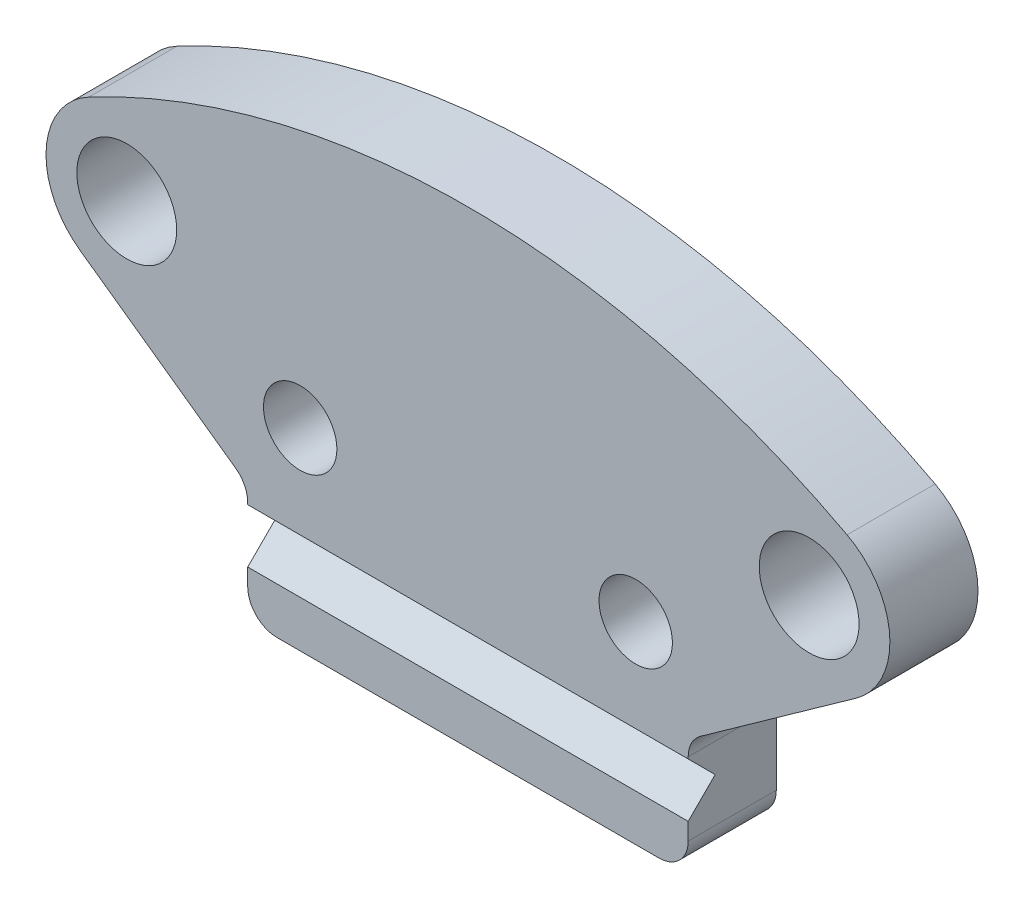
ISO-10303-21;
HEADER;
FILE_DESCRIPTION(('STEP AP214'),'2;1');
FILE_NAME('part.step','',(''),(''),'','','');
FILE_SCHEMA(('AUTOMOTIVE_DESIGN { 1 0 10303 214 1 1 1 1 }'));
ENDSEC;
DATA;
#1=APPLICATION_CONTEXT('core data for automotive mechanical design processes');
#2=APPLICATION_PROTOCOL_DEFINITION('international standard','automotive_design',2000,#1);
#3=PRODUCT_CONTEXT('',#1,'mechanical');
#4=PRODUCT('Part','Part','',(#3));
#5=PRODUCT_RELATED_PRODUCT_CATEGORY('part','',(#4));
#6=PRODUCT_DEFINITION_FORMATION('','',#4);
#7=PRODUCT_DEFINITION_CONTEXT('part definition',#1,'design');
#8=PRODUCT_DEFINITION('design','',#6,#7);
#9=PRODUCT_DEFINITION_SHAPE('','',#8);
#10=(LENGTH_UNIT() NAMED_UNIT(*) SI_UNIT(.MILLI.,.METRE.));
#11=(NAMED_UNIT(*) PLANE_ANGLE_UNIT() SI_UNIT($,.RADIAN.));
#12=(NAMED_UNIT(*) SI_UNIT($,.STERADIAN.) SOLID_ANGLE_UNIT());
#13=UNCERTAINTY_MEASURE_WITH_UNIT(LENGTH_MEASURE(1.E-05),#10,'distance_accuracy_value','');
#14=(GEOMETRIC_REPRESENTATION_CONTEXT(3) GLOBAL_UNCERTAINTY_ASSIGNED_CONTEXT((#13)) GLOBAL_UNIT_ASSIGNED_CONTEXT((#10,
#11,#12)) REPRESENTATION_CONTEXT('',''));
#15=CARTESIAN_POINT('',(0.,0.,0.));
#16=DIRECTION('',(0.,0.,1.));
#17=DIRECTION('',(1.,0.,0.));
#18=AXIS2_PLACEMENT_3D('',#15,#16,#17);
#19=CARTESIAN_POINT('',(-4.99384821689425E-13,8.45677694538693E-13,3.));
#20=DIRECTION('',(0.,0.,1.));
#21=DIRECTION('',(1.,0.,0.));
#22=AXIS2_PLACEMENT_3D('',#19,#20,#21);
#23=PLANE('',#22);
#24=DIRECTION('',(1.,0.,0.));
#25=VECTOR('',#24,1.);
#26=CARTESIAN_POINT('',(-9.59025579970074,11.544994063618,3.));
#27=LINE('',#26,#25);
#28=CARTESIAN_POINT('',(-6.5,11.544994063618,3.));
#29=VERTEX_POINT('',#28);
#30=CARTESIAN_POINT('',(6.5,11.544994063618,3.));
#31=VERTEX_POINT('',#30);
#32=EDGE_CURVE('E206',#29,#31,#27,.T.);
#33=ORIENTED_EDGE('',*,*,#32,.T.);
#34=CARTESIAN_POINT('',(6.5,12.544994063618,3.));
#35=DIRECTION('',(0.,0.,1.));
#36=DIRECTION('',(1.,0.,0.));
#37=AXIS2_PLACEMENT_3D('',#34,#35,#36);
#38=CIRCLE('',#37,1.);
#39=CARTESIAN_POINT('',(7.5,12.544994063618,3.));
#40=VERTEX_POINT('',#39);
#41=EDGE_CURVE('E231',#31,#40,#38,.T.);
#42=ORIENTED_EDGE('',*,*,#41,.T.);
#43=DIRECTION('',(0.,-1.,0.));
#44=VECTOR('',#43,1.);
#45=CARTESIAN_POINT('',(7.5,8.45677694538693E-13,3.));
#46=LINE('',#45,#44);
#47=CARTESIAN_POINT('',(7.5,13.1257552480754,3.));
#48=VERTEX_POINT('',#47);
#49=EDGE_CURVE('E286',#48,#40,#46,.T.);
#50=ORIENTED_EDGE('',*,*,#49,.F.);
#51=DIRECTION('',(-1.,0.,0.));
#52=VECTOR('',#51,1.);
#53=CARTESIAN_POINT('',(15.6377840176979,13.1257552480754,3.));
#54=LINE('',#53,#52);
#55=CARTESIAN_POINT('',(-7.5,13.1257552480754,3.));
#56=VERTEX_POINT('',#55);
#57=EDGE_CURVE('E176',#48,#56,#54,.T.);
#58=ORIENTED_EDGE('',*,*,#57,.T.);
#59=DIRECTION('',(0.,1.,0.));
#60=VECTOR('',#59,1.);
#61=CARTESIAN_POINT('',(-7.5,8.45677694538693E-13,3.));
#62=LINE('',#61,#60);
#63=CARTESIAN_POINT('',(-7.5,12.544994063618,3.));
#64=VERTEX_POINT('',#63);
#65=EDGE_CURVE('E247',#64,#56,#62,.T.);
#66=ORIENTED_EDGE('',*,*,#65,.F.);
#67=CARTESIAN_POINT('',(-6.5,12.544994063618,3.));
#68=DIRECTION('',(0.,0.,1.));
#69=DIRECTION('',(1.,0.,0.));
#70=AXIS2_PLACEMENT_3D('',#67,#68,#69);
#71=CIRCLE('',#70,1.);
#72=EDGE_CURVE('E229',#64,#29,#71,.T.);
#73=ORIENTED_EDGE('',*,*,#72,.T.);
#74=EDGE_LOOP('',(#33,#42,#50,#58,#66,#73));
#75=FACE_BOUND('',#74,.T.);
#76=ADVANCED_FACE('F35',(#75),#23,.T.);
#77=DIRECTION('',(0.,1.,0.));
#78=VECTOR('',#77,1.);
#79=CARTESIAN_POINT('',(-7.5,8.45677694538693E-13,3.));
#80=LINE('',#79,#78);
#81=CARTESIAN_POINT('',(-7.5,14.9642328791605,3.));
#82=VERTEX_POINT('',#81);
#83=CARTESIAN_POINT('',(-7.5,15.0293511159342,3.));
#84=VERTEX_POINT('',#83);
#85=EDGE_CURVE('E291',#82,#84,#80,.T.);
#86=ORIENTED_EDGE('',*,*,#85,.F.);
#87=DIRECTION('',(-1.,0.,0.));
#88=VECTOR('',#87,1.);
#89=CARTESIAN_POINT('',(15.6377840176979,14.9642328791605,3.));
#90=LINE('',#89,#88);
#91=CARTESIAN_POINT('',(7.5,14.9642328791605,3.));
#92=VERTEX_POINT('',#91);
#93=EDGE_CURVE('E166',#92,#82,#90,.T.);
#94=ORIENTED_EDGE('',*,*,#93,.F.);
#95=DIRECTION('',(0.,-1.,0.));
#96=VECTOR('',#95,1.);
#97=CARTESIAN_POINT('',(7.5,8.45677694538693E-13,3.));
#98=LINE('',#97,#96);
#99=CARTESIAN_POINT('',(7.5,15.0293511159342,3.));
#100=VERTEX_POINT('',#99);
#101=EDGE_CURVE('E284',#100,#92,#98,.T.);
#102=ORIENTED_EDGE('',*,*,#101,.F.);
#103=CARTESIAN_POINT('',(8.5,15.0293511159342,3.));
#104=DIRECTION('',(0.,0.,1.));
#105=DIRECTION('',(1.,0.,0.));
#106=AXIS2_PLACEMENT_3D('',#103,#104,#105);
#107=CIRCLE('',#106,1.);
#108=CARTESIAN_POINT('',(7.92008095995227,15.8440252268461,3.));
#109=VERTEX_POINT('',#108);
#110=EDGE_CURVE('E165',#100,#109,#107,.F.);
#111=ORIENTED_EDGE('',*,*,#110,.T.);
#112=DIRECTION('',(-0.81467411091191,-0.579919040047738,0.));
#113=VECTOR('',#112,1.);
#114=CARTESIAN_POINT('',(-4.82185946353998,6.77378013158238,3.));
#115=LINE('',#114,#113);
#116=CARTESIAN_POINT('',(13.2141985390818,19.612599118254,3.000006));
#117=VERTEX_POINT('',#116);
#118=EDGE_CURVE('E150',#117,#109,#115,.T.);
#119=ORIENTED_EDGE('',*,*,#118,.F.);
#120=CARTESIAN_POINT('',(11.6194211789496,21.8529529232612,3.));
#121=DIRECTION('',(0.,0.,1.));
#122=DIRECTION('',(1.,0.,0.));
#123=AXIS2_PLACEMENT_3D('',#120,#121,#122);
#124=CIRCLE('',#123,2.75000000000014);
#125=CARTESIAN_POINT('',(12.9104679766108,24.2810588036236,3.));
#126=VERTEX_POINT('',#125);
#127=EDGE_CURVE('E141',#126,#117,#124,.F.);
#128=ORIENTED_EDGE('',*,*,#127,.F.);
#129=CARTESIAN_POINT('',(-4.99384821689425E-13,8.45677694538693E-13,3.));
#130=DIRECTION('',(0.,0.,1.));
#131=DIRECTION('',(1.,0.,0.));
#132=AXIS2_PLACEMENT_3D('',#129,#130,#131);
#133=CIRCLE('',#132,27.5000000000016);
#134=CARTESIAN_POINT('',(-12.9104679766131,24.2810588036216,3.));
#135=VERTEX_POINT('',#134);
#136=EDGE_CURVE('E151',#135,#126,#133,.F.);
#137=ORIENTED_EDGE('',*,*,#136,.F.);
#138=CARTESIAN_POINT('',(-11.6194211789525,21.8529529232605,3.));
#139=DIRECTION('',(0.,0.,1.));
#140=DIRECTION('',(1.,0.,0.));
#141=AXIS2_PLACEMENT_3D('',#138,#139,#140);
#142=CIRCLE('',#141,2.74999999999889);
#143=CARTESIAN_POINT('',(-13.2141985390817,19.6125991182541,3.));
#144=VERTEX_POINT('',#143);
#145=EDGE_CURVE('E246',#144,#135,#142,.F.);
#146=ORIENTED_EDGE('',*,*,#145,.F.);
#147=DIRECTION('',(-0.81467411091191,0.579919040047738,0.));
#148=VECTOR('',#147,1.);
#149=CARTESIAN_POINT('',(4.82185946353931,6.77378013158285,3.));
#150=LINE('',#149,#148);
#151=CARTESIAN_POINT('',(-7.92008095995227,15.8440252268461,3.));
#152=VERTEX_POINT('',#151);
#153=EDGE_CURVE('E243',#152,#144,#150,.T.);
#154=ORIENTED_EDGE('',*,*,#153,.F.);
#155=CARTESIAN_POINT('',(-8.5,15.0293511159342,3.));
#156=DIRECTION('',(0.,0.,1.));
#157=DIRECTION('',(1.,0.,0.));
#158=AXIS2_PLACEMENT_3D('',#155,#156,#157);
#159=CIRCLE('',#158,1.);
#160=EDGE_CURVE('E43',#152,#84,#159,.F.);
#161=ORIENTED_EDGE('',*,*,#160,.T.);
#162=EDGE_LOOP('',(#86,#94,#102,#111,#119,#128,#137,#146,#154,#161));
#163=FACE_BOUND('',#162,.T.);
#164=CARTESIAN_POINT('',(5.7134101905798,18.1206220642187,3.));
#165=DIRECTION('',(0.,0.,1.));
#166=DIRECTION('',(1.,0.,0.));
#167=AXIS2_PLACEMENT_3D('',#164,#165,#166);
#168=CIRCLE('',#167,1.25);
#169=CARTESIAN_POINT('',(6.9634101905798,18.1206220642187,3.));
#170=VERTEX_POINT('',#169);
#171=EDGE_CURVE('E179',#170,#170,#168,.T.);
#172=ORIENTED_EDGE('',*,*,#171,.F.);
#173=EDGE_LOOP('',(#172));
#174=FACE_BOUND('',#173,.T.);
#175=CARTESIAN_POINT('',(-5.71341019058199,18.1206220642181,3.));
#176=DIRECTION('',(0.,0.,1.));
#177=DIRECTION('',(1.,0.,0.));
#178=AXIS2_PLACEMENT_3D('',#175,#176,#177);
#179=CIRCLE('',#178,1.25);
#180=CARTESIAN_POINT('',(-4.46341019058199,18.1206220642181,3.));
#181=VERTEX_POINT('',#180);
#182=EDGE_CURVE('E187',#181,#181,#179,.T.);
#183=ORIENTED_EDGE('',*,*,#182,.F.);
#184=EDGE_LOOP('',(#183));
#185=FACE_BOUND('',#184,.T.);
#186=CARTESIAN_POINT('',(11.6194211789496,21.8529529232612,3.));
#187=DIRECTION('',(0.,0.,1.));
#188=DIRECTION('',(1.,0.,0.));
#189=AXIS2_PLACEMENT_3D('',#186,#187,#188);
#190=CIRCLE('',#189,1.7);
#191=CARTESIAN_POINT('',(13.3194211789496,21.8529529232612,3.));
#192=VERTEX_POINT('',#191);
#193=EDGE_CURVE('E200',#192,#192,#190,.T.);
#194=ORIENTED_EDGE('',*,*,#193,.F.);
#195=EDGE_LOOP('',(#194));
#196=FACE_BOUND('',#195,.T.);
#197=CARTESIAN_POINT('',(-11.6194211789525,21.8529529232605,3.));
#198=DIRECTION('',(0.,0.,1.));
#199=DIRECTION('',(1.,0.,0.));
#200=AXIS2_PLACEMENT_3D('',#197,#198,#199);
#201=CIRCLE('',#200,1.7);
#202=CARTESIAN_POINT('',(-9.91942117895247,21.8529529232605,3.));
#203=VERTEX_POINT('',#202);
#204=EDGE_CURVE('E194',#203,#203,#201,.T.);
#205=ORIENTED_EDGE('',*,*,#204,.F.);
#206=EDGE_LOOP('',(#205));
#207=FACE_BOUND('',#206,.T.);
#208=ADVANCED_FACE('F162',(#163,#174,#185,#196,#207),#23,.T.);
#209=CARTESIAN_POINT('',(-4.99384821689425E-13,8.45677694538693E-13,0.));
#210=DIRECTION('',(0.,0.,1.));
#211=DIRECTION('',(1.,0.,0.));
#212=AXIS2_PLACEMENT_3D('',#209,#210,#211);
#213=PLANE('',#212);
#214=CARTESIAN_POINT('',(5.7134101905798,18.1206220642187,0.));
#215=DIRECTION('',(0.,0.,1.));
#216=DIRECTION('',(1.,0.,0.));
#217=AXIS2_PLACEMENT_3D('',#214,#215,#216);
#218=CIRCLE('',#217,1.25);
#219=CARTESIAN_POINT('',(6.9634101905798,18.1206220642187,0.));
#220=VERTEX_POINT('',#219);
#221=EDGE_CURVE('E184',#220,#220,#218,.T.);
#222=ORIENTED_EDGE('',*,*,#221,.T.);
#223=EDGE_LOOP('',(#222));
#224=FACE_BOUND('',#223,.T.);
#225=CARTESIAN_POINT('',(-5.71341019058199,18.1206220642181,0.));
#226=DIRECTION('',(0.,0.,1.));
#227=DIRECTION('',(1.,0.,0.));
#228=AXIS2_PLACEMENT_3D('',#225,#226,#227);
#229=CIRCLE('',#228,1.25);
#230=CARTESIAN_POINT('',(-4.46341019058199,18.1206220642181,0.));
#231=VERTEX_POINT('',#230);
#232=EDGE_CURVE('E190',#231,#231,#229,.T.);
#233=ORIENTED_EDGE('',*,*,#232,.T.);
#234=EDGE_LOOP('',(#233));
#235=FACE_BOUND('',#234,.T.);
#236=DIRECTION('',(0.,-1.,0.));
#237=VECTOR('',#236,1.);
#238=CARTESIAN_POINT('',(7.5,15.544994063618,0.));
#239=LINE('',#238,#237);
#240=CARTESIAN_POINT('',(7.5,15.0293511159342,0.));
#241=VERTEX_POINT('',#240);
#242=CARTESIAN_POINT('',(7.5,12.544994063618,0.));
#243=VERTEX_POINT('',#242);
#244=EDGE_CURVE('E317',#241,#243,#239,.T.);
#245=ORIENTED_EDGE('',*,*,#244,.T.);
#246=CARTESIAN_POINT('',(6.5,12.544994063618,0.));
#247=DIRECTION('',(0.,0.,1.));
#248=DIRECTION('',(1.,0.,0.));
#249=AXIS2_PLACEMENT_3D('',#246,#247,#248);
#250=CIRCLE('',#249,1.);
#251=CARTESIAN_POINT('',(6.5,11.544994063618,0.));
#252=VERTEX_POINT('',#251);
#253=EDGE_CURVE('E235',#243,#252,#250,.F.);
#254=ORIENTED_EDGE('',*,*,#253,.T.);
#255=DIRECTION('',(1.,0.,0.));
#256=VECTOR('',#255,1.);
#257=CARTESIAN_POINT('',(-9.59025579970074,11.544994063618,0.));
#258=LINE('',#257,#256);
#259=CARTESIAN_POINT('',(-6.5,11.544994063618,0.));
#260=VERTEX_POINT('',#259);
#261=EDGE_CURVE('E203',#260,#252,#258,.T.);
#262=ORIENTED_EDGE('',*,*,#261,.F.);
#263=CARTESIAN_POINT('',(-6.5,12.544994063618,0.));
#264=DIRECTION('',(0.,0.,1.));
#265=DIRECTION('',(1.,0.,0.));
#266=AXIS2_PLACEMENT_3D('',#263,#264,#265);
#267=CIRCLE('',#266,1.);
#268=CARTESIAN_POINT('',(-7.5,12.544994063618,0.));
#269=VERTEX_POINT('',#268);
#270=EDGE_CURVE('E233',#260,#269,#267,.F.);
#271=ORIENTED_EDGE('',*,*,#270,.T.);
#272=DIRECTION('',(0.,1.,0.));
#273=VECTOR('',#272,1.);
#274=CARTESIAN_POINT('',(-7.5,15.544994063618,0.));
#275=LINE('',#274,#273);
#276=CARTESIAN_POINT('',(-7.5,15.0293511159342,0.));
#277=VERTEX_POINT('',#276);
#278=EDGE_CURVE('E325',#269,#277,#275,.T.);
#279=ORIENTED_EDGE('',*,*,#278,.T.);
#280=CARTESIAN_POINT('',(-8.5,15.0293511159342,0.));
#281=DIRECTION('',(0.,0.,1.));
#282=DIRECTION('',(1.,0.,0.));
#283=AXIS2_PLACEMENT_3D('',#280,#281,#282);
#284=CIRCLE('',#283,1.);
#285=CARTESIAN_POINT('',(-7.92008095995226,15.8440252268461,0.));
#286=VERTEX_POINT('',#285);
#287=EDGE_CURVE('E11',#277,#286,#284,.T.);
#288=ORIENTED_EDGE('',*,*,#287,.T.);
#289=DIRECTION('',(-0.81467411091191,0.579919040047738,0.));
#290=VECTOR('',#289,1.);
#291=CARTESIAN_POINT('',(-13.2141985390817,19.6125991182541,0.));
#292=LINE('',#291,#290);
#293=CARTESIAN_POINT('',(-13.2141985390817,19.6125991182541,0.));
#294=VERTEX_POINT('',#293);
#295=EDGE_CURVE('E327',#286,#294,#292,.T.);
#296=ORIENTED_EDGE('',*,*,#295,.T.);
#297=CARTESIAN_POINT('',(-11.6194211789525,21.8529529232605,0.));
#298=DIRECTION('',(0.,0.,-1.));
#299=DIRECTION('',(1.,0.,0.));
#300=AXIS2_PLACEMENT_3D('',#297,#298,#299);
#301=CIRCLE('',#300,2.74999999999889);
#302=CARTESIAN_POINT('',(-12.9104679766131,24.2810588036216,0.));
#303=VERTEX_POINT('',#302);
#304=EDGE_CURVE('E269',#294,#303,#301,.T.);
#305=ORIENTED_EDGE('',*,*,#304,.T.);
#306=CARTESIAN_POINT('',(-4.99384821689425E-13,8.45677694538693E-13,0.));
#307=DIRECTION('',(0.,0.,-1.));
#308=DIRECTION('',(1.,0.,0.));
#309=AXIS2_PLACEMENT_3D('',#306,#307,#308);
#310=CIRCLE('',#309,27.5000000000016);
#311=CARTESIAN_POINT('',(12.9104679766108,24.2810588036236,0.));
#312=VERTEX_POINT('',#311);
#313=EDGE_CURVE('E275',#303,#312,#310,.T.);
#314=ORIENTED_EDGE('',*,*,#313,.T.);
#315=CARTESIAN_POINT('',(11.6194211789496,21.8529529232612,0.));
#316=DIRECTION('',(0.,0.,-1.));
#317=DIRECTION('',(1.,0.,0.));
#318=AXIS2_PLACEMENT_3D('',#315,#316,#317);
#319=CIRCLE('',#318,2.75000000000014);
#320=CARTESIAN_POINT('',(13.2141985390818,19.612599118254,0.));
#321=VERTEX_POINT('',#320);
#322=EDGE_CURVE('E272',#312,#321,#319,.T.);
#323=ORIENTED_EDGE('',*,*,#322,.T.);
#324=DIRECTION('',(-0.81467411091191,-0.579919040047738,0.));
#325=VECTOR('',#324,1.);
#326=CARTESIAN_POINT('',(13.2141985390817,19.6125991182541,0.));
#327=LINE('',#326,#325);
#328=CARTESIAN_POINT('',(7.92008095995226,15.8440252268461,0.));
#329=VERTEX_POINT('',#328);
#330=EDGE_CURVE('E158',#321,#329,#327,.T.);
#331=ORIENTED_EDGE('',*,*,#330,.T.);
#332=CARTESIAN_POINT('',(8.5,15.0293511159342,0.));
#333=DIRECTION('',(0.,0.,1.));
#334=DIRECTION('',(1.,0.,0.));
#335=AXIS2_PLACEMENT_3D('',#332,#333,#334);
#336=CIRCLE('',#335,1.);
#337=EDGE_CURVE('E337',#329,#241,#336,.T.);
#338=ORIENTED_EDGE('',*,*,#337,.T.);
#339=EDGE_LOOP('',(#245,#254,#262,#271,#279,#288,#296,#305,#314,#323,#331,#338));
#340=FACE_BOUND('',#339,.T.);
#341=CARTESIAN_POINT('',(11.6194211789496,21.8529529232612,0.));
#342=DIRECTION('',(0.,0.,1.));
#343=DIRECTION('',(1.,0.,0.));
#344=AXIS2_PLACEMENT_3D('',#341,#342,#343);
#345=CIRCLE('',#344,1.7);
#346=CARTESIAN_POINT('',(13.3194211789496,21.8529529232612,0.));
#347=VERTEX_POINT('',#346);
#348=EDGE_CURVE('E197',#347,#347,#345,.T.);
#349=ORIENTED_EDGE('',*,*,#348,.T.);
#350=EDGE_LOOP('',(#349));
#351=FACE_BOUND('',#350,.T.);
#352=CARTESIAN_POINT('',(-11.6194211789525,21.8529529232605,0.));
#353=DIRECTION('',(0.,0.,1.));
#354=DIRECTION('',(1.,0.,0.));
#355=AXIS2_PLACEMENT_3D('',#352,#353,#354);
#356=CIRCLE('',#355,1.7);
#357=CARTESIAN_POINT('',(-9.91942117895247,21.8529529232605,0.));
#358=VERTEX_POINT('',#357);
#359=EDGE_CURVE('E193',#358,#358,#356,.T.);
#360=ORIENTED_EDGE('',*,*,#359,.T.);
#361=EDGE_LOOP('',(#360));
#362=FACE_BOUND('',#361,.T.);
#363=ADVANCED_FACE('F314',(#224,#235,#340,#351,#362),#213,.F.);
#364=CARTESIAN_POINT('',(-9.59025579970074,11.544994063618,3.));
#365=DIRECTION('',(0.,1.,0.));
#366=DIRECTION('',(-1.,0.,0.));
#367=AXIS2_PLACEMENT_3D('',#364,#365,#366);
#368=PLANE('',#367);
#369=ORIENTED_EDGE('',*,*,#261,.T.);
#370=DIRECTION('',(0.,0.,1.));
#371=VECTOR('',#370,1.);
#372=CARTESIAN_POINT('',(6.5,11.544994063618,3.));
#373=LINE('',#372,#371);
#374=EDGE_CURVE('E226',#252,#31,#373,.T.);
#375=ORIENTED_EDGE('',*,*,#374,.T.);
#376=ORIENTED_EDGE('',*,*,#32,.F.);
#377=DIRECTION('',(0.,0.,1.));
#378=VECTOR('',#377,1.);
#379=CARTESIAN_POINT('',(-6.5,11.544994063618,3.));
#380=LINE('',#379,#378);
#381=EDGE_CURVE('E224',#29,#260,#380,.F.);
#382=ORIENTED_EDGE('',*,*,#381,.T.);
#383=EDGE_LOOP('',(#369,#375,#376,#382));
#384=FACE_BOUND('',#383,.T.);
#385=ADVANCED_FACE('F319',(#384),#368,.F.);
#386=CARTESIAN_POINT('',(11.6194211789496,21.8529529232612,3.));
#387=DIRECTION('',(0.,0.,-1.));
#388=DIRECTION('',(-1.,0.,0.));
#389=AXIS2_PLACEMENT_3D('',#386,#387,#388);
#390=CYLINDRICAL_SURFACE('',#389,1.7);
#391=ORIENTED_EDGE('',*,*,#193,.T.);
#392=EDGE_LOOP('',(#391));
#393=FACE_BOUND('',#392,.T.);
#394=ORIENTED_EDGE('',*,*,#348,.F.);
#395=EDGE_LOOP('',(#394));
#396=FACE_BOUND('',#395,.T.);
#397=ADVANCED_FACE('F360',(#393,#396),#390,.F.);
#398=CARTESIAN_POINT('',(-11.6194211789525,21.8529529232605,3.));
#399=DIRECTION('',(0.,0.,-1.));
#400=DIRECTION('',(-1.,0.,0.));
#401=AXIS2_PLACEMENT_3D('',#398,#399,#400);
#402=CYLINDRICAL_SURFACE('',#401,1.7);
#403=ORIENTED_EDGE('',*,*,#204,.T.);
#404=EDGE_LOOP('',(#403));
#405=FACE_BOUND('',#404,.T.);
#406=ORIENTED_EDGE('',*,*,#359,.F.);
#407=EDGE_LOOP('',(#406));
#408=FACE_BOUND('',#407,.T.);
#409=ADVANCED_FACE('F369',(#405,#408),#402,.F.);
#410=CARTESIAN_POINT('',(-5.71341019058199,18.1206220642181,3.));
#411=DIRECTION('',(0.,0.,1.));
#412=DIRECTION('',(1.,0.,0.));
#413=AXIS2_PLACEMENT_3D('',#410,#411,#412);
#414=CYLINDRICAL_SURFACE('',#413,1.25);
#415=ORIENTED_EDGE('',*,*,#232,.F.);
#416=EDGE_LOOP('',(#415));
#417=FACE_BOUND('',#416,.T.);
#418=ORIENTED_EDGE('',*,*,#182,.T.);
#419=EDGE_LOOP('',(#418));
#420=FACE_BOUND('',#419,.T.);
#421=ADVANCED_FACE('F374',(#417,#420),#414,.F.);
#422=CARTESIAN_POINT('',(5.7134101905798,18.1206220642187,3.));
#423=DIRECTION('',(0.,0.,1.));
#424=DIRECTION('',(1.,0.,0.));
#425=AXIS2_PLACEMENT_3D('',#422,#423,#424);
#426=CYLINDRICAL_SURFACE('',#425,1.25);
#427=ORIENTED_EDGE('',*,*,#221,.F.);
#428=EDGE_LOOP('',(#427));
#429=FACE_BOUND('',#428,.T.);
#430=ORIENTED_EDGE('',*,*,#171,.T.);
#431=EDGE_LOOP('',(#430));
#432=FACE_BOUND('',#431,.T.);
#433=ADVANCED_FACE('F388',(#429,#432),#426,.F.);
#434=CARTESIAN_POINT('',(15.6377840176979,14.0449940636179,2.08076118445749));
#435=DIRECTION('',(0.,-0.707106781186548,-0.707106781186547));
#436=DIRECTION('',(0.,0.707106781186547,-0.707106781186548));
#437=AXIS2_PLACEMENT_3D('',#434,#435,#436);
#438=PLANE('',#437);
#439=DIRECTION('',(-1.,0.,0.));
#440=VECTOR('',#439,1.);
#441=CARTESIAN_POINT('',(15.6377840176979,14.0449940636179,2.08076118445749));
#442=LINE('',#441,#440);
#443=CARTESIAN_POINT('',(7.5,14.0449940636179,2.08076118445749));
#444=VERTEX_POINT('',#443);
#445=CARTESIAN_POINT('',(-7.5,14.0449940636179,2.08076118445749));
#446=VERTEX_POINT('',#445);
#447=EDGE_CURVE('E169',#444,#446,#442,.T.);
#448=ORIENTED_EDGE('',*,*,#447,.T.);
#449=DIRECTION('',(0.,-0.707106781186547,0.707106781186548));
#450=VECTOR('',#449,1.);
#451=CARTESIAN_POINT('',(-7.5,14.0449940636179,2.08076118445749));
#452=LINE('',#451,#450);
#453=EDGE_CURVE('E289',#446,#56,#452,.T.);
#454=ORIENTED_EDGE('',*,*,#453,.T.);
#455=ORIENTED_EDGE('',*,*,#57,.F.);
#456=DIRECTION('',(0.,0.707106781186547,-0.707106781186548));
#457=VECTOR('',#456,1.);
#458=CARTESIAN_POINT('',(7.5,14.0449940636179,2.08076118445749));
#459=LINE('',#458,#457);
#460=EDGE_CURVE('E160',#48,#444,#459,.T.);
#461=ORIENTED_EDGE('',*,*,#460,.T.);
#462=EDGE_LOOP('',(#448,#454,#455,#461));
#463=FACE_BOUND('',#462,.T.);
#464=ADVANCED_FACE('F300',(#463),#438,.F.);
#465=CARTESIAN_POINT('',(15.6377840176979,14.9642328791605,3.));
#466=DIRECTION('',(0.,0.707106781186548,-0.707106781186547));
#467=DIRECTION('',(0.,0.707106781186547,0.707106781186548));
#468=AXIS2_PLACEMENT_3D('',#465,#466,#467);
#469=PLANE('',#468);
#470=ORIENTED_EDGE('',*,*,#93,.T.);
#471=DIRECTION('',(0.,-0.707106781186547,-0.707106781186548));
#472=VECTOR('',#471,1.);
#473=CARTESIAN_POINT('',(-7.5,14.9642328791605,3.));
#474=LINE('',#473,#472);
#475=EDGE_CURVE('E214',#82,#446,#474,.T.);
#476=ORIENTED_EDGE('',*,*,#475,.T.);
#477=ORIENTED_EDGE('',*,*,#447,.F.);
#478=DIRECTION('',(0.,0.707106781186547,0.707106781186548));
#479=VECTOR('',#478,1.);
#480=CARTESIAN_POINT('',(7.5,14.9642328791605,3.));
#481=LINE('',#480,#479);
#482=EDGE_CURVE('E209',#444,#92,#481,.T.);
#483=ORIENTED_EDGE('',*,*,#482,.T.);
#484=EDGE_LOOP('',(#470,#476,#477,#483));
#485=FACE_BOUND('',#484,.T.);
#486=ADVANCED_FACE('F395',(#485),#469,.F.);
#487=CARTESIAN_POINT('',(13.2141985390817,19.6125991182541,0.));
#488=DIRECTION('',(-0.579919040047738,0.81467411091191,0.));
#489=DIRECTION('',(-0.81467411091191,-0.579919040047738,0.));
#490=AXIS2_PLACEMENT_3D('',#487,#488,#489);
#491=PLANE('',#490);
#492=ORIENTED_EDGE('',*,*,#118,.T.);
#493=DIRECTION('',(0.,0.,1.));
#494=VECTOR('',#493,1.);
#495=CARTESIAN_POINT('',(7.92008095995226,15.8440252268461,0.));
#496=LINE('',#495,#494);
#497=EDGE_CURVE('E222',#109,#329,#496,.F.);
#498=ORIENTED_EDGE('',*,*,#497,.T.);
#499=ORIENTED_EDGE('',*,*,#330,.F.);
#500=DIRECTION('',(0.,0.,1.));
#501=VECTOR('',#500,1.);
#502=CARTESIAN_POINT('',(13.2141985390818,19.612599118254,0.));
#503=LINE('',#502,#501);
#504=EDGE_CURVE('E145',#321,#117,#503,.T.);
#505=ORIENTED_EDGE('',*,*,#504,.T.);
#506=EDGE_LOOP('',(#492,#498,#499,#505));
#507=FACE_BOUND('',#506,.T.);
#508=ADVANCED_FACE('F155',(#507),#491,.F.);
#509=CARTESIAN_POINT('',(11.6194211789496,21.8529529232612,0.));
#510=DIRECTION('',(0.,0.,1.));
#511=DIRECTION('',(1.,0.,0.));
#512=AXIS2_PLACEMENT_3D('',#509,#510,#511);
#513=CYLINDRICAL_SURFACE('',#512,2.75000000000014);
#514=ORIENTED_EDGE('',*,*,#127,.T.);
#515=ORIENTED_EDGE('',*,*,#504,.F.);
#516=ORIENTED_EDGE('',*,*,#322,.F.);
#517=DIRECTION('',(0.,0.,1.));
#518=VECTOR('',#517,1.);
#519=CARTESIAN_POINT('',(12.9104679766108,24.2810588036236,0.));
#520=LINE('',#519,#518);
#521=EDGE_CURVE('E147',#312,#126,#520,.T.);
#522=ORIENTED_EDGE('',*,*,#521,.T.);
#523=EDGE_LOOP('',(#514,#515,#516,#522));
#524=FACE_BOUND('',#523,.T.);
#525=ADVANCED_FACE('F143',(#524),#513,.T.);
#526=CARTESIAN_POINT('',(-4.99384821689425E-13,8.45677694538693E-13,0.));
#527=DIRECTION('',(0.,0.,1.));
#528=DIRECTION('',(1.,0.,0.));
#529=AXIS2_PLACEMENT_3D('',#526,#527,#528);
#530=CYLINDRICAL_SURFACE('',#529,27.5000000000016);
#531=ORIENTED_EDGE('',*,*,#136,.T.);
#532=ORIENTED_EDGE('',*,*,#521,.F.);
#533=ORIENTED_EDGE('',*,*,#313,.F.);
#534=DIRECTION('',(0.,0.,1.));
#535=VECTOR('',#534,1.);
#536=CARTESIAN_POINT('',(-12.9104679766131,24.2810588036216,0.));
#537=LINE('',#536,#535);
#538=EDGE_CURVE('E260',#303,#135,#537,.T.);
#539=ORIENTED_EDGE('',*,*,#538,.T.);
#540=EDGE_LOOP('',(#531,#532,#533,#539));
#541=FACE_BOUND('',#540,.T.);
#542=ADVANCED_FACE('F258',(#541),#530,.T.);
#543=CARTESIAN_POINT('',(-11.6194211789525,21.8529529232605,0.));
#544=DIRECTION('',(0.,0.,1.));
#545=DIRECTION('',(1.,0.,0.));
#546=AXIS2_PLACEMENT_3D('',#543,#544,#545);
#547=CYLINDRICAL_SURFACE('',#546,2.74999999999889);
#548=ORIENTED_EDGE('',*,*,#145,.T.);
#549=ORIENTED_EDGE('',*,*,#538,.F.);
#550=ORIENTED_EDGE('',*,*,#304,.F.);
#551=DIRECTION('',(0.,0.,1.));
#552=VECTOR('',#551,1.);
#553=CARTESIAN_POINT('',(-13.2141985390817,19.6125991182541,0.));
#554=LINE('',#553,#552);
#555=EDGE_CURVE('E267',#294,#144,#554,.T.);
#556=ORIENTED_EDGE('',*,*,#555,.T.);
#557=EDGE_LOOP('',(#548,#549,#550,#556));
#558=FACE_BOUND('',#557,.T.);
#559=ADVANCED_FACE('F264',(#558),#547,.T.);
#560=CARTESIAN_POINT('',(-13.2141985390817,19.6125991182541,0.));
#561=DIRECTION('',(0.579919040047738,0.81467411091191,0.));
#562=DIRECTION('',(-0.81467411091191,0.579919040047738,0.));
#563=AXIS2_PLACEMENT_3D('',#560,#561,#562);
#564=PLANE('',#563);
#565=ORIENTED_EDGE('',*,*,#295,.F.);
#566=DIRECTION('',(0.,0.,1.));
#567=VECTOR('',#566,1.);
#568=CARTESIAN_POINT('',(-7.92008095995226,15.8440252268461,3.));
#569=LINE('',#568,#567);
#570=EDGE_CURVE('E242',#286,#152,#569,.T.);
#571=ORIENTED_EDGE('',*,*,#570,.T.);
#572=ORIENTED_EDGE('',*,*,#153,.T.);
#573=ORIENTED_EDGE('',*,*,#555,.F.);
#574=EDGE_LOOP('',(#565,#571,#572,#573));
#575=FACE_BOUND('',#574,.T.);
#576=ADVANCED_FACE('F336',(#575),#564,.F.);
#577=CARTESIAN_POINT('',(-7.5,15.544994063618,0.));
#578=DIRECTION('',(1.,0.,0.));
#579=DIRECTION('',(0.,0.,-1.));
#580=AXIS2_PLACEMENT_3D('',#577,#578,#579);
#581=PLANE('',#580);
#582=ORIENTED_EDGE('',*,*,#278,.F.);
#583=DIRECTION('',(0.,0.,1.));
#584=VECTOR('',#583,1.);
#585=CARTESIAN_POINT('',(-7.5,12.544994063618,0.));
#586=LINE('',#585,#584);
#587=EDGE_CURVE('E239',#269,#64,#586,.T.);
#588=ORIENTED_EDGE('',*,*,#587,.T.);
#589=ORIENTED_EDGE('',*,*,#65,.T.);
#590=ORIENTED_EDGE('',*,*,#453,.F.);
#591=ORIENTED_EDGE('',*,*,#475,.F.);
#592=ORIENTED_EDGE('',*,*,#85,.T.);
#593=DIRECTION('',(0.,0.,1.));
#594=VECTOR('',#593,1.);
#595=CARTESIAN_POINT('',(-7.5,15.0293511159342,0.));
#596=LINE('',#595,#594);
#597=EDGE_CURVE('E237',#84,#277,#596,.F.);
#598=ORIENTED_EDGE('',*,*,#597,.T.);
#599=EDGE_LOOP('',(#582,#588,#589,#590,#591,#592,#598));
#600=FACE_BOUND('',#599,.T.);
#601=ADVANCED_FACE('F295',(#600),#581,.F.);
#602=CARTESIAN_POINT('',(7.5,15.544994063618,0.));
#603=DIRECTION('',(-1.,0.,0.));
#604=DIRECTION('',(0.,0.,1.));
#605=AXIS2_PLACEMENT_3D('',#602,#603,#604);
#606=PLANE('',#605);
#607=ORIENTED_EDGE('',*,*,#244,.F.);
#608=DIRECTION('',(0.,0.,1.));
#609=VECTOR('',#608,1.);
#610=CARTESIAN_POINT('',(7.5,15.0293511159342,3.));
#611=LINE('',#610,#609);
#612=EDGE_CURVE('E219',#241,#100,#611,.T.);
#613=ORIENTED_EDGE('',*,*,#612,.T.);
#614=ORIENTED_EDGE('',*,*,#101,.T.);
#615=ORIENTED_EDGE('',*,*,#482,.F.);
#616=ORIENTED_EDGE('',*,*,#460,.F.);
#617=ORIENTED_EDGE('',*,*,#49,.T.);
#618=DIRECTION('',(0.,0.,1.));
#619=VECTOR('',#618,1.);
#620=CARTESIAN_POINT('',(7.5,12.544994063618,0.));
#621=LINE('',#620,#619);
#622=EDGE_CURVE('E217',#40,#243,#621,.F.);
#623=ORIENTED_EDGE('',*,*,#622,.T.);
#624=EDGE_LOOP('',(#607,#613,#614,#615,#616,#617,#623));
#625=FACE_BOUND('',#624,.T.);
#626=ADVANCED_FACE('F306',(#625),#606,.F.);
#627=CARTESIAN_POINT('',(8.5,15.0293511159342,0.));
#628=DIRECTION('',(0.,0.,-1.));
#629=DIRECTION('',(-1.,0.,0.));
#630=AXIS2_PLACEMENT_3D('',#627,#628,#629);
#631=CYLINDRICAL_SURFACE('',#630,1.);
#632=ORIENTED_EDGE('',*,*,#337,.F.);
#633=ORIENTED_EDGE('',*,*,#497,.F.);
#634=ORIENTED_EDGE('',*,*,#110,.F.);
#635=ORIENTED_EDGE('',*,*,#612,.F.);
#636=EDGE_LOOP('',(#632,#633,#634,#635));
#637=FACE_BOUND('',#636,.T.);
#638=ADVANCED_FACE('F342',(#637),#631,.F.);
#639=CARTESIAN_POINT('',(6.5,12.544994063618,3.));
#640=DIRECTION('',(0.,0.,1.));
#641=DIRECTION('',(1.,0.,0.));
#642=AXIS2_PLACEMENT_3D('',#639,#640,#641);
#643=CYLINDRICAL_SURFACE('',#642,1.);
#644=ORIENTED_EDGE('',*,*,#253,.F.);
#645=ORIENTED_EDGE('',*,*,#622,.F.);
#646=ORIENTED_EDGE('',*,*,#41,.F.);
#647=ORIENTED_EDGE('',*,*,#374,.F.);
#648=EDGE_LOOP('',(#644,#645,#646,#647));
#649=FACE_BOUND('',#648,.T.);
#650=ADVANCED_FACE('F310',(#649),#643,.T.);
#651=CARTESIAN_POINT('',(-6.5,12.544994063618,0.));
#652=DIRECTION('',(0.,0.,1.));
#653=DIRECTION('',(1.,0.,0.));
#654=AXIS2_PLACEMENT_3D('',#651,#652,#653);
#655=CYLINDRICAL_SURFACE('',#654,1.);
#656=ORIENTED_EDGE('',*,*,#270,.F.);
#657=ORIENTED_EDGE('',*,*,#381,.F.);
#658=ORIENTED_EDGE('',*,*,#72,.F.);
#659=ORIENTED_EDGE('',*,*,#587,.F.);
#660=EDGE_LOOP('',(#656,#657,#658,#659));
#661=FACE_BOUND('',#660,.T.);
#662=ADVANCED_FACE('F323',(#661),#655,.T.);
#663=CARTESIAN_POINT('',(-8.5,15.0293511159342,0.));
#664=DIRECTION('',(0.,0.,-1.));
#665=DIRECTION('',(-1.,0.,0.));
#666=AXIS2_PLACEMENT_3D('',#663,#664,#665);
#667=CYLINDRICAL_SURFACE('',#666,1.);
#668=ORIENTED_EDGE('',*,*,#287,.F.);
#669=ORIENTED_EDGE('',*,*,#597,.F.);
#670=ORIENTED_EDGE('',*,*,#160,.F.);
#671=ORIENTED_EDGE('',*,*,#570,.F.);
#672=EDGE_LOOP('',(#668,#669,#670,#671));
#673=FACE_BOUND('',#672,.T.);
#674=ADVANCED_FACE('F37',(#673),#667,.F.);
#675=CLOSED_SHELL('',(#76,#208,#363,#385,#397,#409,#421,#433,#464,#486,#508,#525,#542,#559,#576,
#601,#626,#638,#650,#662,#674));
#676=MANIFOLD_SOLID_BREP('B2',#675);
#677=ADVANCED_BREP_SHAPE_REPRESENTATION('',(#18,#676),#14);
#678=SHAPE_DEFINITION_REPRESENTATION(#9,#677);
ENDSEC;
END-ISO-10303-21;
